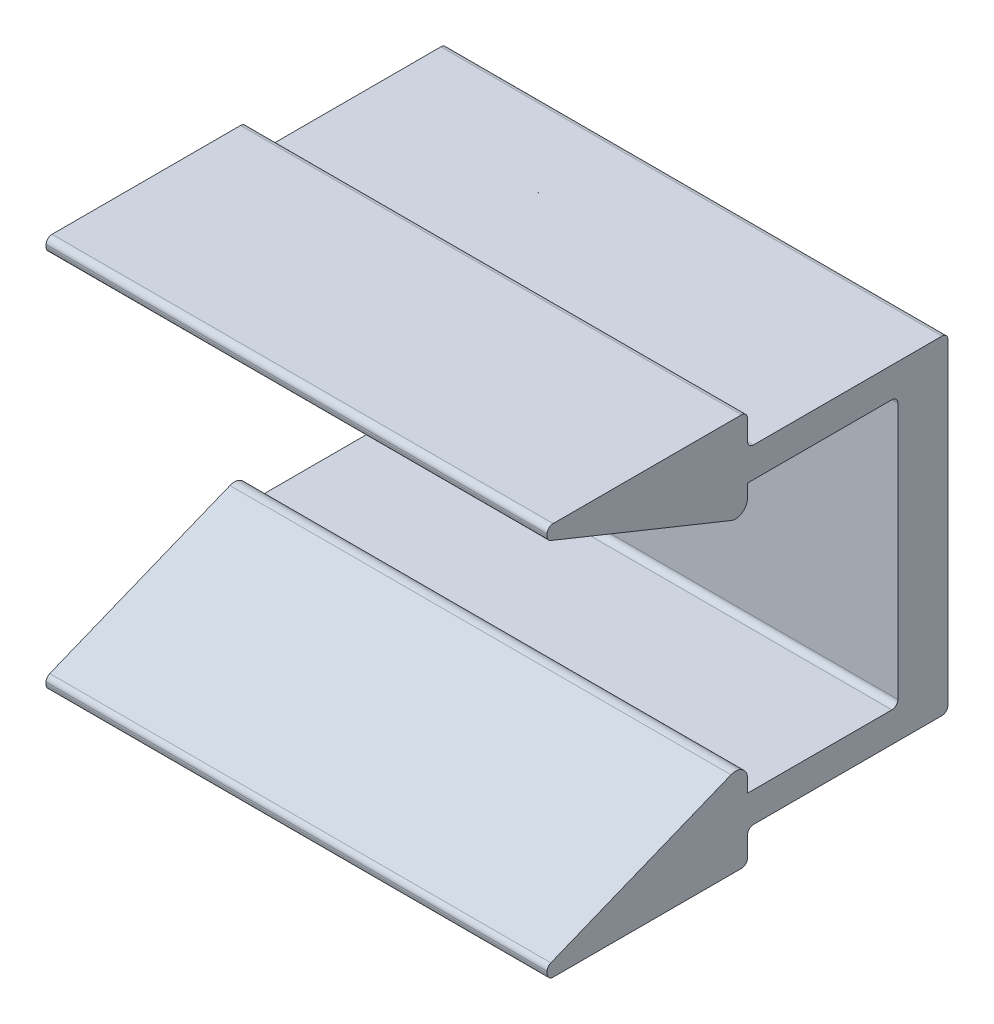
ISO-10303-21;
HEADER;
FILE_DESCRIPTION(('STEP AP214'),'2;1');
FILE_NAME('part.step','',(''),(''),'','','');
FILE_SCHEMA(('AUTOMOTIVE_DESIGN { 1 0 10303 214 1 1 1 1 }'));
ENDSEC;
DATA;
#1=APPLICATION_CONTEXT('core data for automotive mechanical design processes');
#2=APPLICATION_PROTOCOL_DEFINITION('international standard','automotive_design',2000,#1);
#3=PRODUCT_CONTEXT('',#1,'mechanical');
#4=PRODUCT('Part','Part','',(#3));
#5=PRODUCT_RELATED_PRODUCT_CATEGORY('part','',(#4));
#6=PRODUCT_DEFINITION_FORMATION('','',#4);
#7=PRODUCT_DEFINITION_CONTEXT('part definition',#1,'design');
#8=PRODUCT_DEFINITION('design','',#6,#7);
#9=PRODUCT_DEFINITION_SHAPE('','',#8);
#10=(LENGTH_UNIT() NAMED_UNIT(*) SI_UNIT(.MILLI.,.METRE.));
#11=(NAMED_UNIT(*) PLANE_ANGLE_UNIT() SI_UNIT($,.RADIAN.));
#12=(NAMED_UNIT(*) SI_UNIT($,.STERADIAN.) SOLID_ANGLE_UNIT());
#13=UNCERTAINTY_MEASURE_WITH_UNIT(LENGTH_MEASURE(1.E-05),#10,'distance_accuracy_value','');
#14=(GEOMETRIC_REPRESENTATION_CONTEXT(3) GLOBAL_UNCERTAINTY_ASSIGNED_CONTEXT((#13)) GLOBAL_UNIT_ASSIGNED_CONTEXT((#10,
#11,#12)) REPRESENTATION_CONTEXT('',''));
#15=CARTESIAN_POINT('',(0.,0.,0.));
#16=DIRECTION('',(0.,0.,1.));
#17=DIRECTION('',(1.,0.,0.));
#18=AXIS2_PLACEMENT_3D('',#15,#16,#17);
#19=CARTESIAN_POINT('',(15.875,8.128,3.175));
#20=DIRECTION('',(0.,0.,-1.));
#21=DIRECTION('',(-1.,0.,0.));
#22=AXIS2_PLACEMENT_3D('',#19,#20,#21);
#23=PLANE('',#22);
#24=DIRECTION('',(0.,-1.,0.));
#25=VECTOR('',#24,1.);
#26=CARTESIAN_POINT('',(-15.875,8.128,3.175));
#27=LINE('',#26,#25);
#28=CARTESIAN_POINT('',(-15.875,8.128,3.175));
#29=VERTEX_POINT('',#28);
#30=CARTESIAN_POINT('',(-15.875,-8.128,3.175));
#31=VERTEX_POINT('',#30);
#32=EDGE_CURVE('E218',#29,#31,#27,.T.);
#33=ORIENTED_EDGE('',*,*,#32,.T.);
#34=DIRECTION('',(-1.,0.,0.));
#35=VECTOR('',#34,1.);
#36=CARTESIAN_POINT('',(15.875,-8.128,3.175));
#37=LINE('',#36,#35);
#38=CARTESIAN_POINT('',(15.875,-8.128,3.175));
#39=VERTEX_POINT('',#38);
#40=EDGE_CURVE('E426',#39,#31,#37,.T.);
#41=ORIENTED_EDGE('',*,*,#40,.F.);
#42=DIRECTION('',(0.,-1.,0.));
#43=VECTOR('',#42,1.);
#44=CARTESIAN_POINT('',(15.875,8.128,3.175));
#45=LINE('',#44,#43);
#46=CARTESIAN_POINT('',(15.875,8.128,3.175));
#47=VERTEX_POINT('',#46);
#48=EDGE_CURVE('E293',#47,#39,#45,.T.);
#49=ORIENTED_EDGE('',*,*,#48,.F.);
#50=DIRECTION('',(-1.,0.,0.));
#51=VECTOR('',#50,1.);
#52=CARTESIAN_POINT('',(15.875,8.128,3.175));
#53=LINE('',#52,#51);
#54=EDGE_CURVE('E23',#47,#29,#53,.T.);
#55=ORIENTED_EDGE('',*,*,#54,.T.);
#56=EDGE_LOOP('',(#33,#41,#49,#55));
#57=FACE_BOUND('',#56,.T.);
#58=CARTESIAN_POINT('',(0.,0.,3.175));
#59=DIRECTION('',(0.,0.,-1.));
#60=DIRECTION('',(-1.,0.,0.));
#61=AXIS2_PLACEMENT_3D('',#58,#59,#60);
#62=CIRCLE('',#61,4.1656);
#63=CARTESIAN_POINT('',(-4.1656,0.,3.175));
#64=VERTEX_POINT('',#63);
#65=EDGE_CURVE('E230',#64,#64,#62,.F.);
#66=ORIENTED_EDGE('',*,*,#65,.F.);
#67=EDGE_LOOP('',(#66));
#68=FACE_BOUND('',#67,.T.);
#69=ADVANCED_FACE('F14',(#57,#68),#23,.F.);
#70=CARTESIAN_POINT('',(15.875,-10.033,0.));
#71=DIRECTION('',(0.,0.,1.));
#72=DIRECTION('',(1.,0.,0.));
#73=AXIS2_PLACEMENT_3D('',#70,#71,#72);
#74=PLANE('',#73);
#75=DIRECTION('',(0.,1.,0.));
#76=VECTOR('',#75,1.);
#77=CARTESIAN_POINT('',(-15.875,-10.033,0.));
#78=LINE('',#77,#76);
#79=CARTESIAN_POINT('',(-15.875,-10.033,0.));
#80=VERTEX_POINT('',#79);
#81=CARTESIAN_POINT('',(-15.875,10.033,0.));
#82=VERTEX_POINT('',#81);
#83=EDGE_CURVE('E264',#80,#82,#78,.T.);
#84=ORIENTED_EDGE('',*,*,#83,.T.);
#85=DIRECTION('',(-1.,0.,0.));
#86=VECTOR('',#85,1.);
#87=CARTESIAN_POINT('',(15.875,10.033,0.));
#88=LINE('',#87,#86);
#89=CARTESIAN_POINT('',(15.875,10.033,0.));
#90=VERTEX_POINT('',#89);
#91=EDGE_CURVE('E381',#90,#82,#88,.T.);
#92=ORIENTED_EDGE('',*,*,#91,.F.);
#93=DIRECTION('',(0.,1.,0.));
#94=VECTOR('',#93,1.);
#95=CARTESIAN_POINT('',(15.875,-10.033,0.));
#96=LINE('',#95,#94);
#97=CARTESIAN_POINT('',(15.875,-10.033,0.));
#98=VERTEX_POINT('',#97);
#99=EDGE_CURVE('E323',#98,#90,#96,.T.);
#100=ORIENTED_EDGE('',*,*,#99,.F.);
#101=DIRECTION('',(-1.,0.,0.));
#102=VECTOR('',#101,1.);
#103=CARTESIAN_POINT('',(15.875,-10.033,0.));
#104=LINE('',#103,#102);
#105=EDGE_CURVE('E384',#98,#80,#104,.T.);
#106=ORIENTED_EDGE('',*,*,#105,.T.);
#107=EDGE_LOOP('',(#84,#92,#100,#106));
#108=FACE_BOUND('',#107,.T.);
#109=CARTESIAN_POINT('',(0.,0.,0.));
#110=DIRECTION('',(0.,0.,1.));
#111=DIRECTION('',(1.,0.,0.));
#112=AXIS2_PLACEMENT_3D('',#109,#110,#111);
#113=CIRCLE('',#112,4.1656);
#114=CARTESIAN_POINT('',(4.1656,0.,0.));
#115=VERTEX_POINT('',#114);
#116=EDGE_CURVE('E18',#115,#115,#113,.F.);
#117=ORIENTED_EDGE('',*,*,#116,.F.);
#118=EDGE_LOOP('',(#117));
#119=FACE_BOUND('',#118,.T.);
#120=ADVANCED_FACE('F507',(#108,#119),#74,.F.);
#121=CARTESIAN_POINT('',(15.875,8.509,12.7));
#122=DIRECTION('',(0.,1.,0.));
#123=DIRECTION('',(0.,0.,1.));
#124=AXIS2_PLACEMENT_3D('',#121,#122,#123);
#125=PLANE('',#124);
#126=DIRECTION('',(0.,0.,-1.));
#127=VECTOR('',#126,1.);
#128=CARTESIAN_POINT('',(-15.875,8.509,12.7));
#129=LINE('',#128,#127);
#130=CARTESIAN_POINT('',(-15.875,8.509,12.7));
#131=VERTEX_POINT('',#130);
#132=CARTESIAN_POINT('',(-15.875,8.509,3.556));
#133=VERTEX_POINT('',#132);
#134=EDGE_CURVE('E216',#131,#133,#129,.T.);
#135=ORIENTED_EDGE('',*,*,#134,.T.);
#136=DIRECTION('',(-1.,0.,0.));
#137=VECTOR('',#136,1.);
#138=CARTESIAN_POINT('',(15.875,8.509,3.556));
#139=LINE('',#138,#137);
#140=CARTESIAN_POINT('',(15.875,8.509,3.556));
#141=VERTEX_POINT('',#140);
#142=EDGE_CURVE('E9',#141,#133,#139,.T.);
#143=ORIENTED_EDGE('',*,*,#142,.F.);
#144=DIRECTION('',(0.,0.,-1.));
#145=VECTOR('',#144,1.);
#146=CARTESIAN_POINT('',(15.875,8.509,12.7));
#147=LINE('',#146,#145);
#148=CARTESIAN_POINT('',(15.875,8.509,12.7));
#149=VERTEX_POINT('',#148);
#150=EDGE_CURVE('E290',#149,#141,#147,.T.);
#151=ORIENTED_EDGE('',*,*,#150,.F.);
#152=DIRECTION('',(-1.,0.,0.));
#153=VECTOR('',#152,1.);
#154=CARTESIAN_POINT('',(15.875,8.509,12.7));
#155=LINE('',#154,#153);
#156=EDGE_CURVE('E229',#149,#131,#155,.T.);
#157=ORIENTED_EDGE('',*,*,#156,.T.);
#158=EDGE_LOOP('',(#135,#143,#151,#157));
#159=FACE_BOUND('',#158,.T.);
#160=ADVANCED_FACE('F16',(#159),#125,.F.);
#161=CARTESIAN_POINT('',(15.875,8.128,3.556));
#162=DIRECTION('',(-1.,0.,0.));
#163=DIRECTION('',(0.,-1.,0.));
#164=AXIS2_PLACEMENT_3D('',#161,#162,#163);
#165=CYLINDRICAL_SURFACE('',#164,0.381);
#166=CARTESIAN_POINT('',(-15.875,8.128,3.556));
#167=DIRECTION('',(-1.,0.,0.));
#168=DIRECTION('',(0.,-1.,0.));
#169=AXIS2_PLACEMENT_3D('',#166,#167,#168);
#170=CIRCLE('',#169,0.381);
#171=EDGE_CURVE('E212',#133,#29,#170,.T.);
#172=ORIENTED_EDGE('',*,*,#171,.T.);
#173=ORIENTED_EDGE('',*,*,#54,.F.);
#174=CARTESIAN_POINT('',(15.875,8.128,3.556));
#175=DIRECTION('',(-1.,0.,0.));
#176=DIRECTION('',(0.,-1.,0.));
#177=AXIS2_PLACEMENT_3D('',#174,#175,#176);
#178=CIRCLE('',#177,0.381);
#179=EDGE_CURVE('E225',#141,#47,#178,.T.);
#180=ORIENTED_EDGE('',*,*,#179,.F.);
#181=ORIENTED_EDGE('',*,*,#142,.T.);
#182=EDGE_LOOP('',(#172,#173,#180,#181));
#183=FACE_BOUND('',#182,.T.);
#184=ADVANCED_FACE('F224',(#183),#165,.F.);
#185=CARTESIAN_POINT('',(15.875,-8.128,3.556));
#186=DIRECTION('',(-1.,0.,0.));
#187=DIRECTION('',(0.,-1.,0.));
#188=AXIS2_PLACEMENT_3D('',#185,#186,#187);
#189=CYLINDRICAL_SURFACE('',#188,0.381);
#190=CARTESIAN_POINT('',(-15.875,-8.128,3.556));
#191=DIRECTION('',(-1.,0.,0.));
#192=DIRECTION('',(0.,1.,0.));
#193=AXIS2_PLACEMENT_3D('',#190,#191,#192);
#194=CIRCLE('',#193,0.381);
#195=CARTESIAN_POINT('',(-15.875,-8.509,3.556));
#196=VERTEX_POINT('',#195);
#197=EDGE_CURVE('E236',#31,#196,#194,.T.);
#198=ORIENTED_EDGE('',*,*,#197,.T.);
#199=DIRECTION('',(-1.,0.,0.));
#200=VECTOR('',#199,1.);
#201=CARTESIAN_POINT('',(15.875,-8.509,3.556));
#202=LINE('',#201,#200);
#203=CARTESIAN_POINT('',(15.875,-8.509,3.556));
#204=VERTEX_POINT('',#203);
#205=EDGE_CURVE('E423',#204,#196,#202,.T.);
#206=ORIENTED_EDGE('',*,*,#205,.F.);
#207=CARTESIAN_POINT('',(15.875,-8.128,3.556));
#208=DIRECTION('',(-1.,0.,0.));
#209=DIRECTION('',(0.,1.,0.));
#210=AXIS2_PLACEMENT_3D('',#207,#208,#209);
#211=CIRCLE('',#210,0.381);
#212=EDGE_CURVE('E295',#39,#204,#211,.T.);
#213=ORIENTED_EDGE('',*,*,#212,.F.);
#214=ORIENTED_EDGE('',*,*,#40,.T.);
#215=EDGE_LOOP('',(#198,#206,#213,#214));
#216=FACE_BOUND('',#215,.T.);
#217=ADVANCED_FACE('F439',(#216),#189,.F.);
#218=CARTESIAN_POINT('',(15.875,-8.509,12.7));
#219=DIRECTION('',(0.,-1.,0.));
#220=DIRECTION('',(0.,0.,-1.));
#221=AXIS2_PLACEMENT_3D('',#218,#219,#220);
#222=PLANE('',#221);
#223=DIRECTION('',(0.,0.,1.));
#224=VECTOR('',#223,1.);
#225=CARTESIAN_POINT('',(-15.875,-8.509,12.7));
#226=LINE('',#225,#224);
#227=CARTESIAN_POINT('',(-15.875,-8.509,12.7));
#228=VERTEX_POINT('',#227);
#229=EDGE_CURVE('E238',#196,#228,#226,.T.);
#230=ORIENTED_EDGE('',*,*,#229,.T.);
#231=DIRECTION('',(-1.,0.,0.));
#232=VECTOR('',#231,1.);
#233=CARTESIAN_POINT('',(15.875,-8.509,12.7));
#234=LINE('',#233,#232);
#235=CARTESIAN_POINT('',(15.875,-8.509,12.7));
#236=VERTEX_POINT('',#235);
#237=EDGE_CURVE('E420',#236,#228,#234,.T.);
#238=ORIENTED_EDGE('',*,*,#237,.F.);
#239=DIRECTION('',(0.,0.,1.));
#240=VECTOR('',#239,1.);
#241=CARTESIAN_POINT('',(15.875,-8.509,12.7));
#242=LINE('',#241,#240);
#243=EDGE_CURVE('E297',#204,#236,#242,.T.);
#244=ORIENTED_EDGE('',*,*,#243,.F.);
#245=ORIENTED_EDGE('',*,*,#205,.T.);
#246=EDGE_LOOP('',(#230,#238,#244,#245));
#247=FACE_BOUND('',#246,.T.);
#248=ADVANCED_FACE('F442',(#247),#222,.F.);
#249=CARTESIAN_POINT('',(15.875,-7.68257838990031,12.7));
#250=DIRECTION('',(0.,0.,1.));
#251=DIRECTION('',(1.,0.,0.));
#252=AXIS2_PLACEMENT_3D('',#249,#250,#251);
#253=PLANE('',#252);
#254=DIRECTION('',(0.,1.,0.));
#255=VECTOR('',#254,1.);
#256=CARTESIAN_POINT('',(-15.875,-7.68257838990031,12.7));
#257=LINE('',#256,#255);
#258=CARTESIAN_POINT('',(-15.875,-7.68257838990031,12.7));
#259=VERTEX_POINT('',#258);
#260=EDGE_CURVE('E240',#228,#259,#257,.T.);
#261=ORIENTED_EDGE('',*,*,#260,.T.);
#262=DIRECTION('',(-1.,0.,0.));
#263=VECTOR('',#262,1.);
#264=CARTESIAN_POINT('',(15.875,-7.68257838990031,12.7));
#265=LINE('',#264,#263);
#266=CARTESIAN_POINT('',(15.875,-7.68257838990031,12.7));
#267=VERTEX_POINT('',#266);
#268=EDGE_CURVE('E417',#267,#259,#265,.T.);
#269=ORIENTED_EDGE('',*,*,#268,.F.);
#270=DIRECTION('',(0.,1.,0.));
#271=VECTOR('',#270,1.);
#272=CARTESIAN_POINT('',(15.875,-7.68257838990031,12.7));
#273=LINE('',#272,#271);
#274=EDGE_CURVE('E299',#236,#267,#273,.T.);
#275=ORIENTED_EDGE('',*,*,#274,.F.);
#276=ORIENTED_EDGE('',*,*,#237,.T.);
#277=EDGE_LOOP('',(#261,#269,#275,#276));
#278=FACE_BOUND('',#277,.T.);
#279=ADVANCED_FACE('F447',(#278),#253,.F.);
#280=CARTESIAN_POINT('',(15.875,-7.68257838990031,13.462));
#281=DIRECTION('',(-1.,0.,0.));
#282=DIRECTION('',(0.,-1.,0.));
#283=AXIS2_PLACEMENT_3D('',#280,#281,#282);
#284=CYLINDRICAL_SURFACE('',#283,0.762);
#285=CARTESIAN_POINT('',(-15.875,-7.68257838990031,13.462));
#286=DIRECTION('',(1.,0.,0.));
#287=DIRECTION('',(0.,-1.,0.));
#288=AXIS2_PLACEMENT_3D('',#285,#286,#287);
#289=CIRCLE('',#288,0.762);
#290=CARTESIAN_POINT('',(-15.875,-6.97606429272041,13.7474502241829));
#291=VERTEX_POINT('',#290);
#292=EDGE_CURVE('E242',#259,#291,#289,.T.);
#293=ORIENTED_EDGE('',*,*,#292,.T.);
#294=DIRECTION('',(-1.,0.,0.));
#295=VECTOR('',#294,1.);
#296=CARTESIAN_POINT('',(15.875,-6.97606429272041,13.7474502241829));
#297=LINE('',#296,#295);
#298=CARTESIAN_POINT('',(15.875,-6.97606429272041,13.7474502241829));
#299=VERTEX_POINT('',#298);
#300=EDGE_CURVE('E414',#299,#291,#297,.T.);
#301=ORIENTED_EDGE('',*,*,#300,.F.);
#302=CARTESIAN_POINT('',(15.875,-7.68257838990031,13.462));
#303=DIRECTION('',(1.,0.,0.));
#304=DIRECTION('',(0.,-1.,0.));
#305=AXIS2_PLACEMENT_3D('',#302,#303,#304);
#306=CIRCLE('',#305,0.762);
#307=EDGE_CURVE('E301',#267,#299,#306,.T.);
#308=ORIENTED_EDGE('',*,*,#307,.F.);
#309=ORIENTED_EDGE('',*,*,#268,.T.);
#310=EDGE_LOOP('',(#293,#301,#308,#309));
#311=FACE_BOUND('',#310,.T.);
#312=ADVANCED_FACE('F453',(#311),#284,.T.);
#313=CARTESIAN_POINT('',(15.875,-11.587730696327,25.1617251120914));
#314=DIRECTION('',(0.,-0.92718385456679,-0.374606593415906));
#315=DIRECTION('',(0.,0.374606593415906,-0.92718385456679));
#316=AXIS2_PLACEMENT_3D('',#313,#314,#315);
#317=PLANE('',#316);
#318=DIRECTION('',(0.,-0.374606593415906,0.92718385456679));
#319=VECTOR('',#318,1.);
#320=CARTESIAN_POINT('',(-15.875,-11.587730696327,25.1617251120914));
#321=LINE('',#320,#319);
#322=CARTESIAN_POINT('',(-15.875,-11.587730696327,25.1617251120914));
#323=VERTEX_POINT('',#322);
#324=EDGE_CURVE('E244',#291,#323,#321,.T.);
#325=ORIENTED_EDGE('',*,*,#324,.T.);
#326=DIRECTION('',(-1.,0.,0.));
#327=VECTOR('',#326,1.);
#328=CARTESIAN_POINT('',(15.875,-11.587730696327,25.1617251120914));
#329=LINE('',#328,#327);
#330=CARTESIAN_POINT('',(15.875,-11.587730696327,25.1617251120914));
#331=VERTEX_POINT('',#330);
#332=EDGE_CURVE('E411',#331,#323,#329,.T.);
#333=ORIENTED_EDGE('',*,*,#332,.F.);
#334=DIRECTION('',(0.,-0.374606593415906,0.92718385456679));
#335=VECTOR('',#334,1.);
#336=CARTESIAN_POINT('',(15.875,-11.587730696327,25.1617251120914));
#337=LINE('',#336,#335);
#338=EDGE_CURVE('E303',#299,#331,#337,.T.);
#339=ORIENTED_EDGE('',*,*,#338,.F.);
#340=ORIENTED_EDGE('',*,*,#300,.T.);
#341=EDGE_LOOP('',(#325,#333,#339,#340));
#342=FACE_BOUND('',#341,.T.);
#343=ADVANCED_FACE('F457',(#342),#317,.F.);
#344=CARTESIAN_POINT('',(15.875,-11.940987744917,25.019));
#345=DIRECTION('',(-1.,0.,0.));
#346=DIRECTION('',(0.,-1.,0.));
#347=AXIS2_PLACEMENT_3D('',#344,#345,#346);
#348=CYLINDRICAL_SURFACE('',#347,0.381);
#349=CARTESIAN_POINT('',(-15.875,-11.940987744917,25.019));
#350=DIRECTION('',(1.,0.,0.));
#351=DIRECTION('',(0.,-1.,0.));
#352=AXIS2_PLACEMENT_3D('',#349,#350,#351);
#353=CIRCLE('',#352,0.381);
#354=CARTESIAN_POINT('',(-15.875,-11.940987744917,25.4));
#355=VERTEX_POINT('',#354);
#356=EDGE_CURVE('E246',#323,#355,#353,.T.);
#357=ORIENTED_EDGE('',*,*,#356,.T.);
#358=DIRECTION('',(-1.,0.,0.));
#359=VECTOR('',#358,1.);
#360=CARTESIAN_POINT('',(15.875,-11.940987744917,25.4));
#361=LINE('',#360,#359);
#362=CARTESIAN_POINT('',(15.875,-11.940987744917,25.4));
#363=VERTEX_POINT('',#362);
#364=EDGE_CURVE('E408',#363,#355,#361,.T.);
#365=ORIENTED_EDGE('',*,*,#364,.F.);
#366=CARTESIAN_POINT('',(15.875,-11.940987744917,25.019));
#367=DIRECTION('',(1.,0.,0.));
#368=DIRECTION('',(0.,-1.,0.));
#369=AXIS2_PLACEMENT_3D('',#366,#367,#368);
#370=CIRCLE('',#369,0.381);
#371=EDGE_CURVE('E305',#331,#363,#370,.T.);
#372=ORIENTED_EDGE('',*,*,#371,.F.);
#373=ORIENTED_EDGE('',*,*,#332,.T.);
#374=EDGE_LOOP('',(#357,#365,#372,#373));
#375=FACE_BOUND('',#374,.T.);
#376=ADVANCED_FACE('F462',(#375),#348,.T.);
#377=CARTESIAN_POINT('',(15.875,-12.065,25.4));
#378=DIRECTION('',(0.,0.,-1.));
#379=DIRECTION('',(0.,1.,0.));
#380=AXIS2_PLACEMENT_3D('',#377,#378,#379);
#381=PLANE('',#380);
#382=DIRECTION('',(0.,-1.,0.));
#383=VECTOR('',#382,1.);
#384=CARTESIAN_POINT('',(-15.875,-12.065,25.4));
#385=LINE('',#384,#383);
#386=CARTESIAN_POINT('',(-15.875,-12.065,25.4));
#387=VERTEX_POINT('',#386);
#388=EDGE_CURVE('E248',#355,#387,#385,.T.);
#389=ORIENTED_EDGE('',*,*,#388,.T.);
#390=DIRECTION('',(-1.,0.,0.));
#391=VECTOR('',#390,1.);
#392=CARTESIAN_POINT('',(15.875,-12.065,25.4));
#393=LINE('',#392,#391);
#394=CARTESIAN_POINT('',(15.875,-12.065,25.4));
#395=VERTEX_POINT('',#394);
#396=EDGE_CURVE('E405',#395,#387,#393,.T.);
#397=ORIENTED_EDGE('',*,*,#396,.F.);
#398=DIRECTION('',(0.,-1.,0.));
#399=VECTOR('',#398,1.);
#400=CARTESIAN_POINT('',(15.875,-12.065,25.4));
#401=LINE('',#400,#399);
#402=EDGE_CURVE('E307',#363,#395,#401,.T.);
#403=ORIENTED_EDGE('',*,*,#402,.F.);
#404=ORIENTED_EDGE('',*,*,#364,.T.);
#405=EDGE_LOOP('',(#389,#397,#403,#404));
#406=FACE_BOUND('',#405,.T.);
#407=ADVANCED_FACE('F468',(#406),#381,.F.);
#408=CARTESIAN_POINT('',(15.875,-12.065,25.019));
#409=DIRECTION('',(-1.,0.,0.));
#410=DIRECTION('',(0.,-1.,0.));
#411=AXIS2_PLACEMENT_3D('',#408,#409,#410);
#412=CYLINDRICAL_SURFACE('',#411,0.381);
#413=CARTESIAN_POINT('',(-15.875,-12.065,25.019));
#414=DIRECTION('',(1.,0.,0.));
#415=DIRECTION('',(0.,-1.,0.));
#416=AXIS2_PLACEMENT_3D('',#413,#414,#415);
#417=CIRCLE('',#416,0.381);
#418=CARTESIAN_POINT('',(-15.875,-12.446,25.019));
#419=VERTEX_POINT('',#418);
#420=EDGE_CURVE('E250',#387,#419,#417,.T.);
#421=ORIENTED_EDGE('',*,*,#420,.T.);
#422=DIRECTION('',(-1.,0.,0.));
#423=VECTOR('',#422,1.);
#424=CARTESIAN_POINT('',(15.875,-12.446,25.019));
#425=LINE('',#424,#423);
#426=CARTESIAN_POINT('',(15.875,-12.446,25.019));
#427=VERTEX_POINT('',#426);
#428=EDGE_CURVE('E402',#427,#419,#425,.T.);
#429=ORIENTED_EDGE('',*,*,#428,.F.);
#430=CARTESIAN_POINT('',(15.875,-12.065,25.019));
#431=DIRECTION('',(1.,0.,0.));
#432=DIRECTION('',(0.,-1.,0.));
#433=AXIS2_PLACEMENT_3D('',#430,#431,#432);
#434=CIRCLE('',#433,0.381);
#435=EDGE_CURVE('E309',#395,#427,#434,.T.);
#436=ORIENTED_EDGE('',*,*,#435,.F.);
#437=ORIENTED_EDGE('',*,*,#396,.T.);
#438=EDGE_LOOP('',(#421,#429,#436,#437));
#439=FACE_BOUND('',#438,.T.);
#440=ADVANCED_FACE('F472',(#439),#412,.T.);
#441=CARTESIAN_POINT('',(15.875,-12.446,13.081));
#442=DIRECTION('',(0.,1.,0.));
#443=DIRECTION('',(0.,0.,1.));
#444=AXIS2_PLACEMENT_3D('',#441,#442,#443);
#445=PLANE('',#444);
#446=DIRECTION('',(0.,0.,-1.));
#447=VECTOR('',#446,1.);
#448=CARTESIAN_POINT('',(-15.875,-12.446,13.081));
#449=LINE('',#448,#447);
#450=CARTESIAN_POINT('',(-15.875,-12.446,13.081));
#451=VERTEX_POINT('',#450);
#452=EDGE_CURVE('E252',#419,#451,#449,.T.);
#453=ORIENTED_EDGE('',*,*,#452,.T.);
#454=DIRECTION('',(-1.,0.,0.));
#455=VECTOR('',#454,1.);
#456=CARTESIAN_POINT('',(15.875,-12.446,13.081));
#457=LINE('',#456,#455);
#458=CARTESIAN_POINT('',(15.875,-12.446,13.081));
#459=VERTEX_POINT('',#458);
#460=EDGE_CURVE('E399',#459,#451,#457,.T.);
#461=ORIENTED_EDGE('',*,*,#460,.F.);
#462=DIRECTION('',(0.,0.,-1.));
#463=VECTOR('',#462,1.);
#464=CARTESIAN_POINT('',(15.875,-12.446,13.081));
#465=LINE('',#464,#463);
#466=EDGE_CURVE('E311',#427,#459,#465,.T.);
#467=ORIENTED_EDGE('',*,*,#466,.F.);
#468=ORIENTED_EDGE('',*,*,#428,.T.);
#469=EDGE_LOOP('',(#453,#461,#467,#468));
#470=FACE_BOUND('',#469,.T.);
#471=ADVANCED_FACE('F477',(#470),#445,.F.);
#472=CARTESIAN_POINT('',(15.875,-12.065,13.081));
#473=DIRECTION('',(-1.,0.,0.));
#474=DIRECTION('',(0.,-1.,0.));
#475=AXIS2_PLACEMENT_3D('',#472,#473,#474);
#476=CYLINDRICAL_SURFACE('',#475,0.381);
#477=CARTESIAN_POINT('',(-15.875,-12.065,13.081));
#478=DIRECTION('',(1.,0.,0.));
#479=DIRECTION('',(0.,-1.,0.));
#480=AXIS2_PLACEMENT_3D('',#477,#478,#479);
#481=CIRCLE('',#480,0.381);
#482=CARTESIAN_POINT('',(-15.875,-12.065,12.7));
#483=VERTEX_POINT('',#482);
#484=EDGE_CURVE('E254',#451,#483,#481,.T.);
#485=ORIENTED_EDGE('',*,*,#484,.T.);
#486=DIRECTION('',(-1.,0.,0.));
#487=VECTOR('',#486,1.);
#488=CARTESIAN_POINT('',(15.875,-12.065,12.7));
#489=LINE('',#488,#487);
#490=CARTESIAN_POINT('',(15.875,-12.065,12.7));
#491=VERTEX_POINT('',#490);
#492=EDGE_CURVE('E396',#491,#483,#489,.T.);
#493=ORIENTED_EDGE('',*,*,#492,.F.);
#494=CARTESIAN_POINT('',(15.875,-12.065,13.081));
#495=DIRECTION('',(1.,0.,0.));
#496=DIRECTION('',(0.,-1.,0.));
#497=AXIS2_PLACEMENT_3D('',#494,#495,#496);
#498=CIRCLE('',#497,0.381);
#499=EDGE_CURVE('E313',#459,#491,#498,.T.);
#500=ORIENTED_EDGE('',*,*,#499,.F.);
#501=ORIENTED_EDGE('',*,*,#460,.T.);
#502=EDGE_LOOP('',(#485,#493,#500,#501));
#503=FACE_BOUND('',#502,.T.);
#504=ADVANCED_FACE('F483',(#503),#476,.T.);
#505=CARTESIAN_POINT('',(15.875,-10.795,12.7));
#506=DIRECTION('',(0.,0.,1.));
#507=DIRECTION('',(1.,0.,0.));
#508=AXIS2_PLACEMENT_3D('',#505,#506,#507);
#509=PLANE('',#508);
#510=DIRECTION('',(0.,1.,0.));
#511=VECTOR('',#510,1.);
#512=CARTESIAN_POINT('',(-15.875,-10.795,12.7));
#513=LINE('',#512,#511);
#514=CARTESIAN_POINT('',(-15.875,-10.795,12.7));
#515=VERTEX_POINT('',#514);
#516=EDGE_CURVE('E256',#483,#515,#513,.T.);
#517=ORIENTED_EDGE('',*,*,#516,.T.);
#518=DIRECTION('',(-1.,0.,0.));
#519=VECTOR('',#518,1.);
#520=CARTESIAN_POINT('',(15.875,-10.795,12.7));
#521=LINE('',#520,#519);
#522=CARTESIAN_POINT('',(15.875,-10.795,12.7));
#523=VERTEX_POINT('',#522);
#524=EDGE_CURVE('E393',#523,#515,#521,.T.);
#525=ORIENTED_EDGE('',*,*,#524,.F.);
#526=DIRECTION('',(0.,1.,0.));
#527=VECTOR('',#526,1.);
#528=CARTESIAN_POINT('',(15.875,-10.795,12.7));
#529=LINE('',#528,#527);
#530=EDGE_CURVE('E315',#491,#523,#529,.T.);
#531=ORIENTED_EDGE('',*,*,#530,.F.);
#532=ORIENTED_EDGE('',*,*,#492,.T.);
#533=EDGE_LOOP('',(#517,#525,#531,#532));
#534=FACE_BOUND('',#533,.T.);
#535=ADVANCED_FACE('F487',(#534),#509,.F.);
#536=CARTESIAN_POINT('',(15.875,-10.795,12.319));
#537=DIRECTION('',(-1.,0.,0.));
#538=DIRECTION('',(0.,-1.,0.));
#539=AXIS2_PLACEMENT_3D('',#536,#537,#538);
#540=CYLINDRICAL_SURFACE('',#539,0.381);
#541=CARTESIAN_POINT('',(-15.875,-10.795,12.319));
#542=DIRECTION('',(-1.,0.,0.));
#543=DIRECTION('',(0.,1.,0.));
#544=AXIS2_PLACEMENT_3D('',#541,#542,#543);
#545=CIRCLE('',#544,0.381);
#546=CARTESIAN_POINT('',(-15.875,-10.414,12.319));
#547=VERTEX_POINT('',#546);
#548=EDGE_CURVE('E258',#515,#547,#545,.T.);
#549=ORIENTED_EDGE('',*,*,#548,.T.);
#550=DIRECTION('',(-1.,0.,0.));
#551=VECTOR('',#550,1.);
#552=CARTESIAN_POINT('',(15.875,-10.414,12.319));
#553=LINE('',#552,#551);
#554=CARTESIAN_POINT('',(15.875,-10.414,12.319));
#555=VERTEX_POINT('',#554);
#556=EDGE_CURVE('E390',#555,#547,#553,.T.);
#557=ORIENTED_EDGE('',*,*,#556,.F.);
#558=CARTESIAN_POINT('',(15.875,-10.795,12.319));
#559=DIRECTION('',(-1.,0.,0.));
#560=DIRECTION('',(0.,1.,0.));
#561=AXIS2_PLACEMENT_3D('',#558,#559,#560);
#562=CIRCLE('',#561,0.381);
#563=EDGE_CURVE('E317',#523,#555,#562,.T.);
#564=ORIENTED_EDGE('',*,*,#563,.F.);
#565=ORIENTED_EDGE('',*,*,#524,.T.);
#566=EDGE_LOOP('',(#549,#557,#564,#565));
#567=FACE_BOUND('',#566,.T.);
#568=ADVANCED_FACE('F492',(#567),#540,.F.);
#569=CARTESIAN_POINT('',(15.875,-10.414,0.381));
#570=DIRECTION('',(0.,1.,0.));
#571=DIRECTION('',(-1.,0.,0.));
#572=AXIS2_PLACEMENT_3D('',#569,#570,#571);
#573=PLANE('',#572);
#574=DIRECTION('',(0.,0.,-1.));
#575=VECTOR('',#574,1.);
#576=CARTESIAN_POINT('',(-15.875,-10.414,0.381));
#577=LINE('',#576,#575);
#578=CARTESIAN_POINT('',(-15.875,-10.414,0.381));
#579=VERTEX_POINT('',#578);
#580=EDGE_CURVE('E260',#547,#579,#577,.T.);
#581=ORIENTED_EDGE('',*,*,#580,.T.);
#582=DIRECTION('',(-1.,0.,0.));
#583=VECTOR('',#582,1.);
#584=CARTESIAN_POINT('',(15.875,-10.414,0.381));
#585=LINE('',#584,#583);
#586=CARTESIAN_POINT('',(15.875,-10.414,0.381));
#587=VERTEX_POINT('',#586);
#588=EDGE_CURVE('E387',#587,#579,#585,.T.);
#589=ORIENTED_EDGE('',*,*,#588,.F.);
#590=DIRECTION('',(0.,0.,-1.));
#591=VECTOR('',#590,1.);
#592=CARTESIAN_POINT('',(15.875,-10.414,0.381));
#593=LINE('',#592,#591);
#594=EDGE_CURVE('E319',#555,#587,#593,.T.);
#595=ORIENTED_EDGE('',*,*,#594,.F.);
#596=ORIENTED_EDGE('',*,*,#556,.T.);
#597=EDGE_LOOP('',(#581,#589,#595,#596));
#598=FACE_BOUND('',#597,.T.);
#599=ADVANCED_FACE('F498',(#598),#573,.F.);
#600=CARTESIAN_POINT('',(15.875,-10.033,0.381));
#601=DIRECTION('',(-1.,0.,0.));
#602=DIRECTION('',(0.,-1.,0.));
#603=AXIS2_PLACEMENT_3D('',#600,#601,#602);
#604=CYLINDRICAL_SURFACE('',#603,0.381);
#605=CARTESIAN_POINT('',(-15.875,-10.033,0.381));
#606=DIRECTION('',(1.,0.,0.));
#607=DIRECTION('',(0.,-1.,0.));
#608=AXIS2_PLACEMENT_3D('',#605,#606,#607);
#609=CIRCLE('',#608,0.381);
#610=EDGE_CURVE('E262',#579,#80,#609,.T.);
#611=ORIENTED_EDGE('',*,*,#610,.T.);
#612=ORIENTED_EDGE('',*,*,#105,.F.);
#613=CARTESIAN_POINT('',(15.875,-10.033,0.381));
#614=DIRECTION('',(1.,0.,0.));
#615=DIRECTION('',(0.,-1.,0.));
#616=AXIS2_PLACEMENT_3D('',#613,#614,#615);
#617=CIRCLE('',#616,0.381);
#618=EDGE_CURVE('E321',#587,#98,#617,.T.);
#619=ORIENTED_EDGE('',*,*,#618,.F.);
#620=ORIENTED_EDGE('',*,*,#588,.T.);
#621=EDGE_LOOP('',(#611,#612,#619,#620));
#622=FACE_BOUND('',#621,.T.);
#623=ADVANCED_FACE('F502',(#622),#604,.T.);
#624=CARTESIAN_POINT('',(15.875,10.033,0.381));
#625=DIRECTION('',(-1.,0.,0.));
#626=DIRECTION('',(0.,-1.,0.));
#627=AXIS2_PLACEMENT_3D('',#624,#625,#626);
#628=CYLINDRICAL_SURFACE('',#627,0.381);
#629=CARTESIAN_POINT('',(-15.875,10.033,0.381));
#630=DIRECTION('',(1.,0.,0.));
#631=DIRECTION('',(0.,1.,0.));
#632=AXIS2_PLACEMENT_3D('',#629,#630,#631);
#633=CIRCLE('',#632,0.381);
#634=CARTESIAN_POINT('',(-15.875,10.414,0.381));
#635=VERTEX_POINT('',#634);
#636=EDGE_CURVE('E266',#82,#635,#633,.T.);
#637=ORIENTED_EDGE('',*,*,#636,.T.);
#638=DIRECTION('',(-1.,0.,0.));
#639=VECTOR('',#638,1.);
#640=CARTESIAN_POINT('',(15.875,10.414,0.381));
#641=LINE('',#640,#639);
#642=CARTESIAN_POINT('',(15.875,10.414,0.381));
#643=VERTEX_POINT('',#642);
#644=EDGE_CURVE('E378',#643,#635,#641,.T.);
#645=ORIENTED_EDGE('',*,*,#644,.F.);
#646=CARTESIAN_POINT('',(15.875,10.033,0.381));
#647=DIRECTION('',(1.,0.,0.));
#648=DIRECTION('',(0.,1.,0.));
#649=AXIS2_PLACEMENT_3D('',#646,#647,#648);
#650=CIRCLE('',#649,0.381);
#651=EDGE_CURVE('E325',#90,#643,#650,.T.);
#652=ORIENTED_EDGE('',*,*,#651,.F.);
#653=ORIENTED_EDGE('',*,*,#91,.T.);
#654=EDGE_LOOP('',(#637,#645,#652,#653));
#655=FACE_BOUND('',#654,.T.);
#656=ADVANCED_FACE('F514',(#655),#628,.T.);
#657=CARTESIAN_POINT('',(15.875,10.414,0.381));
#658=DIRECTION('',(0.,-1.,0.));
#659=DIRECTION('',(1.,0.,0.));
#660=AXIS2_PLACEMENT_3D('',#657,#658,#659);
#661=PLANE('',#660);
#662=DIRECTION('',(0.,0.,1.));
#663=VECTOR('',#662,1.);
#664=CARTESIAN_POINT('',(-15.875,10.414,0.381));
#665=LINE('',#664,#663);
#666=CARTESIAN_POINT('',(-15.875,10.414,12.319));
#667=VERTEX_POINT('',#666);
#668=EDGE_CURVE('E268',#635,#667,#665,.T.);
#669=ORIENTED_EDGE('',*,*,#668,.T.);
#670=DIRECTION('',(-1.,0.,0.));
#671=VECTOR('',#670,1.);
#672=CARTESIAN_POINT('',(15.875,10.414,12.319));
#673=LINE('',#672,#671);
#674=CARTESIAN_POINT('',(15.875,10.414,12.319));
#675=VERTEX_POINT('',#674);
#676=EDGE_CURVE('E375',#675,#667,#673,.T.);
#677=ORIENTED_EDGE('',*,*,#676,.F.);
#678=DIRECTION('',(0.,0.,1.));
#679=VECTOR('',#678,1.);
#680=CARTESIAN_POINT('',(15.875,10.414,0.381));
#681=LINE('',#680,#679);
#682=EDGE_CURVE('E327',#643,#675,#681,.T.);
#683=ORIENTED_EDGE('',*,*,#682,.F.);
#684=ORIENTED_EDGE('',*,*,#644,.T.);
#685=EDGE_LOOP('',(#669,#677,#683,#684));
#686=FACE_BOUND('',#685,.T.);
#687=ADVANCED_FACE('F518',(#686),#661,.F.);
#688=CARTESIAN_POINT('',(15.875,10.795,12.319));
#689=DIRECTION('',(-1.,0.,0.));
#690=DIRECTION('',(0.,-1.,0.));
#691=AXIS2_PLACEMENT_3D('',#688,#689,#690);
#692=CYLINDRICAL_SURFACE('',#691,0.381);
#693=CARTESIAN_POINT('',(-15.875,10.795,12.319));
#694=DIRECTION('',(-1.,0.,0.));
#695=DIRECTION('',(0.,-1.,0.));
#696=AXIS2_PLACEMENT_3D('',#693,#694,#695);
#697=CIRCLE('',#696,0.381);
#698=CARTESIAN_POINT('',(-15.875,10.795,12.7));
#699=VERTEX_POINT('',#698);
#700=EDGE_CURVE('E270',#667,#699,#697,.T.);
#701=ORIENTED_EDGE('',*,*,#700,.T.);
#702=DIRECTION('',(-1.,0.,0.));
#703=VECTOR('',#702,1.);
#704=CARTESIAN_POINT('',(15.875,10.795,12.7));
#705=LINE('',#704,#703);
#706=CARTESIAN_POINT('',(15.875,10.795,12.7));
#707=VERTEX_POINT('',#706);
#708=EDGE_CURVE('E372',#707,#699,#705,.T.);
#709=ORIENTED_EDGE('',*,*,#708,.F.);
#710=CARTESIAN_POINT('',(15.875,10.795,12.319));
#711=DIRECTION('',(-1.,0.,0.));
#712=DIRECTION('',(0.,-1.,0.));
#713=AXIS2_PLACEMENT_3D('',#710,#711,#712);
#714=CIRCLE('',#713,0.381);
#715=EDGE_CURVE('E329',#675,#707,#714,.T.);
#716=ORIENTED_EDGE('',*,*,#715,.F.);
#717=ORIENTED_EDGE('',*,*,#676,.T.);
#718=EDGE_LOOP('',(#701,#709,#716,#717));
#719=FACE_BOUND('',#718,.T.);
#720=ADVANCED_FACE('F523',(#719),#692,.F.);
#721=CARTESIAN_POINT('',(15.875,10.795,12.7));
#722=DIRECTION('',(0.,0.,1.));
#723=DIRECTION('',(1.,0.,0.));
#724=AXIS2_PLACEMENT_3D('',#721,#722,#723);
#725=PLANE('',#724);
#726=DIRECTION('',(0.,1.,0.));
#727=VECTOR('',#726,1.);
#728=CARTESIAN_POINT('',(-15.875,10.795,12.7));
#729=LINE('',#728,#727);
#730=CARTESIAN_POINT('',(-15.875,12.065,12.7));
#731=VERTEX_POINT('',#730);
#732=EDGE_CURVE('E272',#699,#731,#729,.T.);
#733=ORIENTED_EDGE('',*,*,#732,.T.);
#734=DIRECTION('',(-1.,0.,0.));
#735=VECTOR('',#734,1.);
#736=CARTESIAN_POINT('',(15.875,12.065,12.7));
#737=LINE('',#736,#735);
#738=CARTESIAN_POINT('',(15.875,12.065,12.7));
#739=VERTEX_POINT('',#738);
#740=EDGE_CURVE('E369',#739,#731,#737,.T.);
#741=ORIENTED_EDGE('',*,*,#740,.F.);
#742=DIRECTION('',(0.,1.,0.));
#743=VECTOR('',#742,1.);
#744=CARTESIAN_POINT('',(15.875,10.795,12.7));
#745=LINE('',#744,#743);
#746=EDGE_CURVE('E331',#707,#739,#745,.T.);
#747=ORIENTED_EDGE('',*,*,#746,.F.);
#748=ORIENTED_EDGE('',*,*,#708,.T.);
#749=EDGE_LOOP('',(#733,#741,#747,#748));
#750=FACE_BOUND('',#749,.T.);
#751=ADVANCED_FACE('F529',(#750),#725,.F.);
#752=CARTESIAN_POINT('',(15.875,12.065,13.081));
#753=DIRECTION('',(-1.,0.,0.));
#754=DIRECTION('',(0.,-1.,0.));
#755=AXIS2_PLACEMENT_3D('',#752,#753,#754);
#756=CYLINDRICAL_SURFACE('',#755,0.381);
#757=CARTESIAN_POINT('',(-15.875,12.065,13.081));
#758=DIRECTION('',(1.,0.,0.));
#759=DIRECTION('',(0.,1.,0.));
#760=AXIS2_PLACEMENT_3D('',#757,#758,#759);
#761=CIRCLE('',#760,0.381);
#762=CARTESIAN_POINT('',(-15.875,12.446,13.081));
#763=VERTEX_POINT('',#762);
#764=EDGE_CURVE('E274',#731,#763,#761,.T.);
#765=ORIENTED_EDGE('',*,*,#764,.T.);
#766=DIRECTION('',(-1.,0.,0.));
#767=VECTOR('',#766,1.);
#768=CARTESIAN_POINT('',(15.875,12.446,13.081));
#769=LINE('',#768,#767);
#770=CARTESIAN_POINT('',(15.875,12.446,13.081));
#771=VERTEX_POINT('',#770);
#772=EDGE_CURVE('E366',#771,#763,#769,.T.);
#773=ORIENTED_EDGE('',*,*,#772,.F.);
#774=CARTESIAN_POINT('',(15.875,12.065,13.081));
#775=DIRECTION('',(1.,0.,0.));
#776=DIRECTION('',(0.,1.,0.));
#777=AXIS2_PLACEMENT_3D('',#774,#775,#776);
#778=CIRCLE('',#777,0.381);
#779=EDGE_CURVE('E333',#739,#771,#778,.T.);
#780=ORIENTED_EDGE('',*,*,#779,.F.);
#781=ORIENTED_EDGE('',*,*,#740,.T.);
#782=EDGE_LOOP('',(#765,#773,#780,#781));
#783=FACE_BOUND('',#782,.T.);
#784=ADVANCED_FACE('F533',(#783),#756,.T.);
#785=CARTESIAN_POINT('',(15.875,12.446,13.081));
#786=DIRECTION('',(0.,-1.,0.));
#787=DIRECTION('',(0.,0.,-1.));
#788=AXIS2_PLACEMENT_3D('',#785,#786,#787);
#789=PLANE('',#788);
#790=DIRECTION('',(0.,0.,1.));
#791=VECTOR('',#790,1.);
#792=CARTESIAN_POINT('',(-15.875,12.446,13.081));
#793=LINE('',#792,#791);
#794=CARTESIAN_POINT('',(-15.875,12.446,25.019));
#795=VERTEX_POINT('',#794);
#796=EDGE_CURVE('E276',#763,#795,#793,.T.);
#797=ORIENTED_EDGE('',*,*,#796,.T.);
#798=DIRECTION('',(-1.,0.,0.));
#799=VECTOR('',#798,1.);
#800=CARTESIAN_POINT('',(15.875,12.446,25.019));
#801=LINE('',#800,#799);
#802=CARTESIAN_POINT('',(15.875,12.446,25.019));
#803=VERTEX_POINT('',#802);
#804=EDGE_CURVE('E363',#803,#795,#801,.T.);
#805=ORIENTED_EDGE('',*,*,#804,.F.);
#806=DIRECTION('',(0.,0.,1.));
#807=VECTOR('',#806,1.);
#808=CARTESIAN_POINT('',(15.875,12.446,13.081));
#809=LINE('',#808,#807);
#810=EDGE_CURVE('E335',#771,#803,#809,.T.);
#811=ORIENTED_EDGE('',*,*,#810,.F.);
#812=ORIENTED_EDGE('',*,*,#772,.T.);
#813=EDGE_LOOP('',(#797,#805,#811,#812));
#814=FACE_BOUND('',#813,.T.);
#815=ADVANCED_FACE('F538',(#814),#789,.F.);
#816=CARTESIAN_POINT('',(15.875,12.065,25.019));
#817=DIRECTION('',(-1.,0.,0.));
#818=DIRECTION('',(0.,-1.,0.));
#819=AXIS2_PLACEMENT_3D('',#816,#817,#818);
#820=CYLINDRICAL_SURFACE('',#819,0.381);
#821=CARTESIAN_POINT('',(-15.875,12.065,25.019));
#822=DIRECTION('',(1.,0.,0.));
#823=DIRECTION('',(0.,1.,0.));
#824=AXIS2_PLACEMENT_3D('',#821,#822,#823);
#825=CIRCLE('',#824,0.381);
#826=CARTESIAN_POINT('',(-15.875,12.065,25.4));
#827=VERTEX_POINT('',#826);
#828=EDGE_CURVE('E278',#795,#827,#825,.T.);
#829=ORIENTED_EDGE('',*,*,#828,.T.);
#830=DIRECTION('',(-1.,0.,0.));
#831=VECTOR('',#830,1.);
#832=CARTESIAN_POINT('',(15.875,12.065,25.4));
#833=LINE('',#832,#831);
#834=CARTESIAN_POINT('',(15.875,12.065,25.4));
#835=VERTEX_POINT('',#834);
#836=EDGE_CURVE('E360',#835,#827,#833,.T.);
#837=ORIENTED_EDGE('',*,*,#836,.F.);
#838=CARTESIAN_POINT('',(15.875,12.065,25.019));
#839=DIRECTION('',(1.,0.,0.));
#840=DIRECTION('',(0.,1.,0.));
#841=AXIS2_PLACEMENT_3D('',#838,#839,#840);
#842=CIRCLE('',#841,0.381);
#843=EDGE_CURVE('E337',#803,#835,#842,.T.);
#844=ORIENTED_EDGE('',*,*,#843,.F.);
#845=ORIENTED_EDGE('',*,*,#804,.T.);
#846=EDGE_LOOP('',(#829,#837,#844,#845));
#847=FACE_BOUND('',#846,.T.);
#848=ADVANCED_FACE('F544',(#847),#820,.T.);
#849=CARTESIAN_POINT('',(15.875,12.065,25.4));
#850=DIRECTION('',(0.,0.,-1.));
#851=DIRECTION('',(0.,1.,0.));
#852=AXIS2_PLACEMENT_3D('',#849,#850,#851);
#853=PLANE('',#852);
#854=DIRECTION('',(0.,-1.,0.));
#855=VECTOR('',#854,1.);
#856=CARTESIAN_POINT('',(-15.875,12.065,25.4));
#857=LINE('',#856,#855);
#858=CARTESIAN_POINT('',(-15.875,11.940987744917,25.4));
#859=VERTEX_POINT('',#858);
#860=EDGE_CURVE('E280',#827,#859,#857,.T.);
#861=ORIENTED_EDGE('',*,*,#860,.T.);
#862=DIRECTION('',(-1.,0.,0.));
#863=VECTOR('',#862,1.);
#864=CARTESIAN_POINT('',(15.875,11.940987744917,25.4));
#865=LINE('',#864,#863);
#866=CARTESIAN_POINT('',(15.875,11.940987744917,25.4));
#867=VERTEX_POINT('',#866);
#868=EDGE_CURVE('E357',#867,#859,#865,.T.);
#869=ORIENTED_EDGE('',*,*,#868,.F.);
#870=DIRECTION('',(0.,-1.,0.));
#871=VECTOR('',#870,1.);
#872=CARTESIAN_POINT('',(15.875,12.065,25.4));
#873=LINE('',#872,#871);
#874=EDGE_CURVE('E339',#835,#867,#873,.T.);
#875=ORIENTED_EDGE('',*,*,#874,.F.);
#876=ORIENTED_EDGE('',*,*,#836,.T.);
#877=EDGE_LOOP('',(#861,#869,#875,#876));
#878=FACE_BOUND('',#877,.T.);
#879=ADVANCED_FACE('F548',(#878),#853,.F.);
#880=CARTESIAN_POINT('',(15.875,11.940987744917,25.019));
#881=DIRECTION('',(-1.,0.,0.));
#882=DIRECTION('',(0.,-1.,0.));
#883=AXIS2_PLACEMENT_3D('',#880,#881,#882);
#884=CYLINDRICAL_SURFACE('',#883,0.381);
#885=CARTESIAN_POINT('',(-15.875,11.940987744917,25.019));
#886=DIRECTION('',(1.,0.,0.));
#887=DIRECTION('',(0.,1.,0.));
#888=AXIS2_PLACEMENT_3D('',#885,#886,#887);
#889=CIRCLE('',#888,0.381);
#890=CARTESIAN_POINT('',(-15.875,11.587730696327,25.1617251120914));
#891=VERTEX_POINT('',#890);
#892=EDGE_CURVE('E282',#859,#891,#889,.T.);
#893=ORIENTED_EDGE('',*,*,#892,.T.);
#894=DIRECTION('',(-1.,0.,0.));
#895=VECTOR('',#894,1.);
#896=CARTESIAN_POINT('',(15.875,11.587730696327,25.1617251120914));
#897=LINE('',#896,#895);
#898=CARTESIAN_POINT('',(15.875,11.587730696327,25.1617251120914));
#899=VERTEX_POINT('',#898);
#900=EDGE_CURVE('E354',#899,#891,#897,.T.);
#901=ORIENTED_EDGE('',*,*,#900,.F.);
#902=CARTESIAN_POINT('',(15.875,11.940987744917,25.019));
#903=DIRECTION('',(1.,0.,0.));
#904=DIRECTION('',(0.,1.,0.));
#905=AXIS2_PLACEMENT_3D('',#902,#903,#904);
#906=CIRCLE('',#905,0.381);
#907=EDGE_CURVE('E341',#867,#899,#906,.T.);
#908=ORIENTED_EDGE('',*,*,#907,.F.);
#909=ORIENTED_EDGE('',*,*,#868,.T.);
#910=EDGE_LOOP('',(#893,#901,#908,#909));
#911=FACE_BOUND('',#910,.T.);
#912=ADVANCED_FACE('F553',(#911),#884,.T.);
#913=CARTESIAN_POINT('',(15.875,11.587730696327,25.1617251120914));
#914=DIRECTION('',(0.,0.92718385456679,-0.374606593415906));
#915=DIRECTION('',(0.,0.374606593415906,0.92718385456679));
#916=AXIS2_PLACEMENT_3D('',#913,#914,#915);
#917=PLANE('',#916);
#918=DIRECTION('',(0.,-0.374606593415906,-0.92718385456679));
#919=VECTOR('',#918,1.);
#920=CARTESIAN_POINT('',(-15.875,11.587730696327,25.1617251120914));
#921=LINE('',#920,#919);
#922=CARTESIAN_POINT('',(-15.875,6.97606429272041,13.7474502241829));
#923=VERTEX_POINT('',#922);
#924=EDGE_CURVE('E284',#891,#923,#921,.T.);
#925=ORIENTED_EDGE('',*,*,#924,.T.);
#926=DIRECTION('',(-1.,0.,0.));
#927=VECTOR('',#926,1.);
#928=CARTESIAN_POINT('',(15.875,6.97606429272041,13.7474502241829));
#929=LINE('',#928,#927);
#930=CARTESIAN_POINT('',(15.875,6.97606429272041,13.7474502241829));
#931=VERTEX_POINT('',#930);
#932=EDGE_CURVE('E351',#931,#923,#929,.T.);
#933=ORIENTED_EDGE('',*,*,#932,.F.);
#934=DIRECTION('',(0.,-0.374606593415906,-0.92718385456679));
#935=VECTOR('',#934,1.);
#936=CARTESIAN_POINT('',(15.875,11.587730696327,25.1617251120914));
#937=LINE('',#936,#935);
#938=EDGE_CURVE('E343',#899,#931,#937,.T.);
#939=ORIENTED_EDGE('',*,*,#938,.F.);
#940=ORIENTED_EDGE('',*,*,#900,.T.);
#941=EDGE_LOOP('',(#925,#933,#939,#940));
#942=FACE_BOUND('',#941,.T.);
#943=ADVANCED_FACE('F557',(#942),#917,.F.);
#944=CARTESIAN_POINT('',(15.875,7.68257838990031,13.462));
#945=DIRECTION('',(-1.,0.,0.));
#946=DIRECTION('',(0.,-1.,0.));
#947=AXIS2_PLACEMENT_3D('',#944,#945,#946);
#948=CYLINDRICAL_SURFACE('',#947,0.762);
#949=CARTESIAN_POINT('',(-15.875,7.68257838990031,13.462));
#950=DIRECTION('',(1.,0.,0.));
#951=DIRECTION('',(0.,1.,0.));
#952=AXIS2_PLACEMENT_3D('',#949,#950,#951);
#953=CIRCLE('',#952,0.762);
#954=CARTESIAN_POINT('',(-15.875,7.68257838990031,12.7));
#955=VERTEX_POINT('',#954);
#956=EDGE_CURVE('E286',#923,#955,#953,.T.);
#957=ORIENTED_EDGE('',*,*,#956,.T.);
#958=DIRECTION('',(-1.,0.,0.));
#959=VECTOR('',#958,1.);
#960=CARTESIAN_POINT('',(15.875,7.68257838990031,12.7));
#961=LINE('',#960,#959);
#962=CARTESIAN_POINT('',(15.875,7.68257838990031,12.7));
#963=VERTEX_POINT('',#962);
#964=EDGE_CURVE('E348',#963,#955,#961,.T.);
#965=ORIENTED_EDGE('',*,*,#964,.F.);
#966=CARTESIAN_POINT('',(15.875,7.68257838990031,13.462));
#967=DIRECTION('',(1.,0.,0.));
#968=DIRECTION('',(0.,1.,0.));
#969=AXIS2_PLACEMENT_3D('',#966,#967,#968);
#970=CIRCLE('',#969,0.762);
#971=EDGE_CURVE('E35',#931,#963,#970,.T.);
#972=ORIENTED_EDGE('',*,*,#971,.F.);
#973=ORIENTED_EDGE('',*,*,#932,.T.);
#974=EDGE_LOOP('',(#957,#965,#972,#973));
#975=FACE_BOUND('',#974,.T.);
#976=ADVANCED_FACE('F561',(#975),#948,.T.);
#977=CARTESIAN_POINT('',(15.875,7.68257838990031,12.7));
#978=DIRECTION('',(0.,0.,1.));
#979=DIRECTION('',(1.,0.,0.));
#980=AXIS2_PLACEMENT_3D('',#977,#978,#979);
#981=PLANE('',#980);
#982=DIRECTION('',(0.,1.,0.));
#983=VECTOR('',#982,1.);
#984=CARTESIAN_POINT('',(-15.875,7.68257838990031,12.7));
#985=LINE('',#984,#983);
#986=EDGE_CURVE('E288',#955,#131,#985,.T.);
#987=ORIENTED_EDGE('',*,*,#986,.T.);
#988=ORIENTED_EDGE('',*,*,#156,.F.);
#989=DIRECTION('',(0.,1.,0.));
#990=VECTOR('',#989,1.);
#991=CARTESIAN_POINT('',(15.875,7.68257838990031,12.7));
#992=LINE('',#991,#990);
#993=EDGE_CURVE('E30',#963,#149,#992,.T.);
#994=ORIENTED_EDGE('',*,*,#993,.F.);
#995=ORIENTED_EDGE('',*,*,#964,.T.);
#996=EDGE_LOOP('',(#987,#988,#994,#995));
#997=FACE_BOUND('',#996,.T.);
#998=ADVANCED_FACE('F563',(#997),#981,.F.);
#999=CARTESIAN_POINT('',(15.875,8.128,3.556));
#1000=DIRECTION('',(-1.,0.,0.));
#1001=DIRECTION('',(0.,-1.,0.));
#1002=AXIS2_PLACEMENT_3D('',#999,#1000,#1001);
#1003=PLANE('',#1002);
#1004=ORIENTED_EDGE('',*,*,#150,.T.);
#1005=ORIENTED_EDGE('',*,*,#179,.T.);
#1006=ORIENTED_EDGE('',*,*,#48,.T.);
#1007=ORIENTED_EDGE('',*,*,#212,.T.);
#1008=ORIENTED_EDGE('',*,*,#243,.T.);
#1009=ORIENTED_EDGE('',*,*,#274,.T.);
#1010=ORIENTED_EDGE('',*,*,#307,.T.);
#1011=ORIENTED_EDGE('',*,*,#338,.T.);
#1012=ORIENTED_EDGE('',*,*,#371,.T.);
#1013=ORIENTED_EDGE('',*,*,#402,.T.);
#1014=ORIENTED_EDGE('',*,*,#435,.T.);
#1015=ORIENTED_EDGE('',*,*,#466,.T.);
#1016=ORIENTED_EDGE('',*,*,#499,.T.);
#1017=ORIENTED_EDGE('',*,*,#530,.T.);
#1018=ORIENTED_EDGE('',*,*,#563,.T.);
#1019=ORIENTED_EDGE('',*,*,#594,.T.);
#1020=ORIENTED_EDGE('',*,*,#618,.T.);
#1021=ORIENTED_EDGE('',*,*,#99,.T.);
#1022=ORIENTED_EDGE('',*,*,#651,.T.);
#1023=ORIENTED_EDGE('',*,*,#682,.T.);
#1024=ORIENTED_EDGE('',*,*,#715,.T.);
#1025=ORIENTED_EDGE('',*,*,#746,.T.);
#1026=ORIENTED_EDGE('',*,*,#779,.T.);
#1027=ORIENTED_EDGE('',*,*,#810,.T.);
#1028=ORIENTED_EDGE('',*,*,#843,.T.);
#1029=ORIENTED_EDGE('',*,*,#874,.T.);
#1030=ORIENTED_EDGE('',*,*,#907,.T.);
#1031=ORIENTED_EDGE('',*,*,#938,.T.);
#1032=ORIENTED_EDGE('',*,*,#971,.T.);
#1033=ORIENTED_EDGE('',*,*,#993,.T.);
#1034=EDGE_LOOP('',(#1004,#1005,#1006,#1007,#1008,#1009,#1010,#1011,#1012,#1013,#1014,#1015,
#1016,#1017,#1018,#1019,#1020,#1021,#1022,#1023,#1024,#1025,#1026,#1027,#1028,#1029,#1030,#1031,
#1032,#1033));
#1035=FACE_BOUND('',#1034,.T.);
#1036=ADVANCED_FACE('F434',(#1035),#1003,.F.);
#1037=CARTESIAN_POINT('',(-15.875,8.128,3.556));
#1038=DIRECTION('',(-1.,0.,0.));
#1039=DIRECTION('',(0.,-1.,0.));
#1040=AXIS2_PLACEMENT_3D('',#1037,#1038,#1039);
#1041=PLANE('',#1040);
#1042=ORIENTED_EDGE('',*,*,#134,.F.);
#1043=ORIENTED_EDGE('',*,*,#986,.F.);
#1044=ORIENTED_EDGE('',*,*,#956,.F.);
#1045=ORIENTED_EDGE('',*,*,#924,.F.);
#1046=ORIENTED_EDGE('',*,*,#892,.F.);
#1047=ORIENTED_EDGE('',*,*,#860,.F.);
#1048=ORIENTED_EDGE('',*,*,#828,.F.);
#1049=ORIENTED_EDGE('',*,*,#796,.F.);
#1050=ORIENTED_EDGE('',*,*,#764,.F.);
#1051=ORIENTED_EDGE('',*,*,#732,.F.);
#1052=ORIENTED_EDGE('',*,*,#700,.F.);
#1053=ORIENTED_EDGE('',*,*,#668,.F.);
#1054=ORIENTED_EDGE('',*,*,#636,.F.);
#1055=ORIENTED_EDGE('',*,*,#83,.F.);
#1056=ORIENTED_EDGE('',*,*,#610,.F.);
#1057=ORIENTED_EDGE('',*,*,#580,.F.);
#1058=ORIENTED_EDGE('',*,*,#548,.F.);
#1059=ORIENTED_EDGE('',*,*,#516,.F.);
#1060=ORIENTED_EDGE('',*,*,#484,.F.);
#1061=ORIENTED_EDGE('',*,*,#452,.F.);
#1062=ORIENTED_EDGE('',*,*,#420,.F.);
#1063=ORIENTED_EDGE('',*,*,#388,.F.);
#1064=ORIENTED_EDGE('',*,*,#356,.F.);
#1065=ORIENTED_EDGE('',*,*,#324,.F.);
#1066=ORIENTED_EDGE('',*,*,#292,.F.);
#1067=ORIENTED_EDGE('',*,*,#260,.F.);
#1068=ORIENTED_EDGE('',*,*,#229,.F.);
#1069=ORIENTED_EDGE('',*,*,#197,.F.);
#1070=ORIENTED_EDGE('',*,*,#32,.F.);
#1071=ORIENTED_EDGE('',*,*,#171,.F.);
#1072=EDGE_LOOP('',(#1042,#1043,#1044,#1045,#1046,#1047,#1048,#1049,#1050,#1051,#1052,#1053,
#1054,#1055,#1056,#1057,#1058,#1059,#1060,#1061,#1062,#1063,#1064,#1065,#1066,#1067,#1068,#1069,
#1070,#1071));
#1073=FACE_BOUND('',#1072,.T.);
#1074=ADVANCED_FACE('F213',(#1073),#1041,.T.);
#1075=CARTESIAN_POINT('',(0.,0.,8.84725331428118));
#1076=DIRECTION('',(0.,0.,1.));
#1077=DIRECTION('',(1.,0.,0.));
#1078=AXIS2_PLACEMENT_3D('',#1075,#1076,#1077);
#1079=CYLINDRICAL_SURFACE('',#1078,4.1656);
#1080=ORIENTED_EDGE('',*,*,#116,.T.);
#1081=EDGE_LOOP('',(#1080));
#1082=FACE_BOUND('',#1081,.T.);
#1083=ORIENTED_EDGE('',*,*,#65,.T.);
#1084=EDGE_LOOP('',(#1083));
#1085=FACE_BOUND('',#1084,.T.);
#1086=ADVANCED_FACE('F799',(#1082,#1085),#1079,.F.);
#1087=CLOSED_SHELL('',(#69,#120,#160,#184,#217,#248,#279,#312,#343,#376,#407,#440,#471,#504,
#535,#568,#599,#623,#656,#687,#720,#751,#784,#815,#848,#879,#912,#943,#976,#998,#1036,#1074,#1086));
#1088=MANIFOLD_SOLID_BREP('B1',#1087);
#1089=ADVANCED_BREP_SHAPE_REPRESENTATION('',(#18,#1088),#14);
#1090=SHAPE_DEFINITION_REPRESENTATION(#9,#1089);
ENDSEC;
END-ISO-10303-21;
